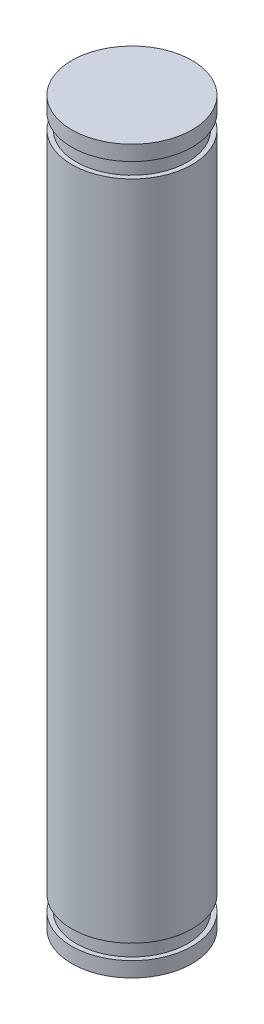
ISO-10303-21;
HEADER;
FILE_DESCRIPTION(('STEP AP214'),'2;1');
FILE_NAME('part.step','',(''),(''),'','','');
FILE_SCHEMA(('AUTOMOTIVE_DESIGN { 1 0 10303 214 1 1 1 1 }'));
ENDSEC;
DATA;
#1=APPLICATION_CONTEXT('core data for automotive mechanical design processes');
#2=APPLICATION_PROTOCOL_DEFINITION('international standard','automotive_design',2000,#1);
#3=PRODUCT_CONTEXT('',#1,'mechanical');
#4=PRODUCT('Part','Part','',(#3));
#5=PRODUCT_RELATED_PRODUCT_CATEGORY('part','',(#4));
#6=PRODUCT_DEFINITION_FORMATION('','',#4);
#7=PRODUCT_DEFINITION_CONTEXT('part definition',#1,'design');
#8=PRODUCT_DEFINITION('design','',#6,#7);
#9=PRODUCT_DEFINITION_SHAPE('','',#8);
#10=(LENGTH_UNIT() NAMED_UNIT(*) SI_UNIT(.MILLI.,.METRE.));
#11=(NAMED_UNIT(*) PLANE_ANGLE_UNIT() SI_UNIT($,.RADIAN.));
#12=(NAMED_UNIT(*) SI_UNIT($,.STERADIAN.) SOLID_ANGLE_UNIT());
#13=UNCERTAINTY_MEASURE_WITH_UNIT(LENGTH_MEASURE(1.E-05),#10,'distance_accuracy_value','');
#14=(GEOMETRIC_REPRESENTATION_CONTEXT(3) GLOBAL_UNCERTAINTY_ASSIGNED_CONTEXT((#13)) GLOBAL_UNIT_ASSIGNED_CONTEXT((#10,
#11,#12)) REPRESENTATION_CONTEXT('',''));
#15=CARTESIAN_POINT('',(0.,0.,0.));
#16=DIRECTION('',(0.,0.,1.));
#17=DIRECTION('',(1.,0.,0.));
#18=AXIS2_PLACEMENT_3D('',#15,#16,#17);
#19=CARTESIAN_POINT('',(0.,1.,0.));
#20=DIRECTION('',(0.,-1.,0.));
#21=DIRECTION('',(0.,0.,-1.));
#22=AXIS2_PLACEMENT_3D('',#19,#20,#21);
#23=CYLINDRICAL_SURFACE('',#22,4.);
#24=CARTESIAN_POINT('',(0.,1.,0.));
#25=DIRECTION('',(0.,1.,0.));
#26=DIRECTION('',(0.,0.,1.));
#27=AXIS2_PLACEMENT_3D('',#24,#25,#26);
#28=CIRCLE('',#27,4.);
#29=CARTESIAN_POINT('',(0.,1.,4.));
#30=VERTEX_POINT('',#29);
#31=EDGE_CURVE('E10',#30,#30,#28,.T.);
#32=ORIENTED_EDGE('',*,*,#31,.F.);
#33=EDGE_LOOP('',(#32));
#34=FACE_BOUND('',#33,.T.);
#35=CARTESIAN_POINT('',(0.,0.,0.));
#36=DIRECTION('',(0.,1.,0.));
#37=DIRECTION('',(0.,0.,1.));
#38=AXIS2_PLACEMENT_3D('',#35,#36,#37);
#39=CIRCLE('',#38,4.);
#40=CARTESIAN_POINT('',(0.,0.,4.));
#41=VERTEX_POINT('',#40);
#42=EDGE_CURVE('E35',#41,#41,#39,.T.);
#43=ORIENTED_EDGE('',*,*,#42,.T.);
#44=EDGE_LOOP('',(#43));
#45=FACE_BOUND('',#44,.T.);
#46=ADVANCED_FACE('F32',(#34,#45),#23,.T.);
#47=CARTESIAN_POINT('',(0.,1.,0.));
#48=DIRECTION('',(0.,1.,0.));
#49=DIRECTION('',(0.,0.,1.));
#50=AXIS2_PLACEMENT_3D('',#47,#48,#49);
#51=PLANE('',#50);
#52=CARTESIAN_POINT('',(0.,1.,0.));
#53=DIRECTION('',(0.,1.,0.));
#54=DIRECTION('',(0.,0.,1.));
#55=AXIS2_PLACEMENT_3D('',#52,#53,#54);
#56=CIRCLE('',#55,3.7);
#57=CARTESIAN_POINT('',(0.,1.,3.7));
#58=VERTEX_POINT('',#57);
#59=EDGE_CURVE('E44',#58,#58,#56,.T.);
#60=ORIENTED_EDGE('',*,*,#59,.F.);
#61=EDGE_LOOP('',(#60));
#62=FACE_BOUND('',#61,.T.);
#63=ORIENTED_EDGE('',*,*,#31,.T.);
#64=EDGE_LOOP('',(#63));
#65=FACE_BOUND('',#64,.T.);
#66=ADVANCED_FACE('F86',(#62,#65),#51,.T.);
#67=CARTESIAN_POINT('',(0.,0.,0.));
#68=DIRECTION('',(0.,1.,0.));
#69=DIRECTION('',(0.,0.,1.));
#70=AXIS2_PLACEMENT_3D('',#67,#68,#69);
#71=PLANE('',#70);
#72=ORIENTED_EDGE('',*,*,#42,.F.);
#73=EDGE_LOOP('',(#72));
#74=FACE_BOUND('',#73,.T.);
#75=ADVANCED_FACE('F91',(#74),#71,.F.);
#76=CARTESIAN_POINT('',(0.,2.,0.));
#77=DIRECTION('',(0.,-1.,0.));
#78=DIRECTION('',(0.,0.,-1.));
#79=AXIS2_PLACEMENT_3D('',#76,#77,#78);
#80=CYLINDRICAL_SURFACE('',#79,3.7);
#81=CARTESIAN_POINT('',(0.,2.,0.));
#82=DIRECTION('',(0.,1.,0.));
#83=DIRECTION('',(0.,0.,1.));
#84=AXIS2_PLACEMENT_3D('',#81,#82,#83);
#85=CIRCLE('',#84,3.7);
#86=CARTESIAN_POINT('',(0.,2.,3.7));
#87=VERTEX_POINT('',#86);
#88=EDGE_CURVE('E42',#87,#87,#85,.T.);
#89=ORIENTED_EDGE('',*,*,#88,.F.);
#90=EDGE_LOOP('',(#89));
#91=FACE_BOUND('',#90,.T.);
#92=ORIENTED_EDGE('',*,*,#59,.T.);
#93=EDGE_LOOP('',(#92));
#94=FACE_BOUND('',#93,.T.);
#95=ADVANCED_FACE('F98',(#91,#94),#80,.T.);
#96=CARTESIAN_POINT('',(0.,46.,0.));
#97=DIRECTION('',(0.,-1.,0.));
#98=DIRECTION('',(0.,0.,-1.));
#99=AXIS2_PLACEMENT_3D('',#96,#97,#98);
#100=CYLINDRICAL_SURFACE('',#99,4.);
#101=CARTESIAN_POINT('',(0.,46.,0.));
#102=DIRECTION('',(0.,1.,0.));
#103=DIRECTION('',(0.,0.,1.));
#104=AXIS2_PLACEMENT_3D('',#101,#102,#103);
#105=CIRCLE('',#104,4.);
#106=CARTESIAN_POINT('',(0.,46.,4.));
#107=VERTEX_POINT('',#106);
#108=EDGE_CURVE('E47',#107,#107,#105,.T.);
#109=ORIENTED_EDGE('',*,*,#108,.F.);
#110=EDGE_LOOP('',(#109));
#111=FACE_BOUND('',#110,.T.);
#112=CARTESIAN_POINT('',(0.,2.,0.));
#113=DIRECTION('',(0.,1.,0.));
#114=DIRECTION('',(0.,0.,1.));
#115=AXIS2_PLACEMENT_3D('',#112,#113,#114);
#116=CIRCLE('',#115,4.);
#117=CARTESIAN_POINT('',(0.,2.,4.));
#118=VERTEX_POINT('',#117);
#119=EDGE_CURVE('E50',#118,#118,#116,.T.);
#120=ORIENTED_EDGE('',*,*,#119,.T.);
#121=EDGE_LOOP('',(#120));
#122=FACE_BOUND('',#121,.T.);
#123=ADVANCED_FACE('F102',(#111,#122),#100,.T.);
#124=CARTESIAN_POINT('',(0.,46.,0.));
#125=DIRECTION('',(0.,1.,0.));
#126=DIRECTION('',(0.,0.,1.));
#127=AXIS2_PLACEMENT_3D('',#124,#125,#126);
#128=PLANE('',#127);
#129=CARTESIAN_POINT('',(0.,46.,0.));
#130=DIRECTION('',(0.,1.,0.));
#131=DIRECTION('',(0.,0.,1.));
#132=AXIS2_PLACEMENT_3D('',#129,#130,#131);
#133=CIRCLE('',#132,3.7);
#134=CARTESIAN_POINT('',(0.,46.,3.7));
#135=VERTEX_POINT('',#134);
#136=EDGE_CURVE('E56',#135,#135,#133,.T.);
#137=ORIENTED_EDGE('',*,*,#136,.F.);
#138=EDGE_LOOP('',(#137));
#139=FACE_BOUND('',#138,.T.);
#140=ORIENTED_EDGE('',*,*,#108,.T.);
#141=EDGE_LOOP('',(#140));
#142=FACE_BOUND('',#141,.T.);
#143=ADVANCED_FACE('F108',(#139,#142),#128,.T.);
#144=CARTESIAN_POINT('',(0.,2.,0.));
#145=DIRECTION('',(0.,1.,0.));
#146=DIRECTION('',(0.,0.,1.));
#147=AXIS2_PLACEMENT_3D('',#144,#145,#146);
#148=PLANE('',#147);
#149=ORIENTED_EDGE('',*,*,#88,.T.);
#150=EDGE_LOOP('',(#149));
#151=FACE_BOUND('',#150,.T.);
#152=ORIENTED_EDGE('',*,*,#119,.F.);
#153=EDGE_LOOP('',(#152));
#154=FACE_BOUND('',#153,.T.);
#155=ADVANCED_FACE('F110',(#151,#154),#148,.F.);
#156=CARTESIAN_POINT('',(0.,47.,0.));
#157=DIRECTION('',(0.,-1.,0.));
#158=DIRECTION('',(0.,0.,-1.));
#159=AXIS2_PLACEMENT_3D('',#156,#157,#158);
#160=CYLINDRICAL_SURFACE('',#159,3.7);
#161=CARTESIAN_POINT('',(0.,47.,0.));
#162=DIRECTION('',(0.,1.,0.));
#163=DIRECTION('',(0.,0.,1.));
#164=AXIS2_PLACEMENT_3D('',#161,#162,#163);
#165=CIRCLE('',#164,3.7);
#166=CARTESIAN_POINT('',(0.,47.,3.7));
#167=VERTEX_POINT('',#166);
#168=EDGE_CURVE('E53',#167,#167,#165,.T.);
#169=ORIENTED_EDGE('',*,*,#168,.F.);
#170=EDGE_LOOP('',(#169));
#171=FACE_BOUND('',#170,.T.);
#172=ORIENTED_EDGE('',*,*,#136,.T.);
#173=EDGE_LOOP('',(#172));
#174=FACE_BOUND('',#173,.T.);
#175=ADVANCED_FACE('F73',(#171,#174),#160,.T.);
#176=CARTESIAN_POINT('',(0.,48.,0.));
#177=DIRECTION('',(0.,-1.,0.));
#178=DIRECTION('',(0.,0.,-1.));
#179=AXIS2_PLACEMENT_3D('',#176,#177,#178);
#180=CYLINDRICAL_SURFACE('',#179,4.);
#181=CARTESIAN_POINT('',(0.,48.,0.));
#182=DIRECTION('',(0.,1.,0.));
#183=DIRECTION('',(0.,0.,1.));
#184=AXIS2_PLACEMENT_3D('',#181,#182,#183);
#185=CIRCLE('',#184,4.);
#186=CARTESIAN_POINT('',(0.,48.,4.));
#187=VERTEX_POINT('',#186);
#188=EDGE_CURVE('E59',#187,#187,#185,.T.);
#189=ORIENTED_EDGE('',*,*,#188,.F.);
#190=EDGE_LOOP('',(#189));
#191=FACE_BOUND('',#190,.T.);
#192=CARTESIAN_POINT('',(0.,47.,0.));
#193=DIRECTION('',(0.,1.,0.));
#194=DIRECTION('',(0.,0.,1.));
#195=AXIS2_PLACEMENT_3D('',#192,#193,#194);
#196=CIRCLE('',#195,4.);
#197=CARTESIAN_POINT('',(0.,47.,4.));
#198=VERTEX_POINT('',#197);
#199=EDGE_CURVE('E62',#198,#198,#196,.T.);
#200=ORIENTED_EDGE('',*,*,#199,.T.);
#201=EDGE_LOOP('',(#200));
#202=FACE_BOUND('',#201,.T.);
#203=ADVANCED_FACE('F70',(#191,#202),#180,.T.);
#204=CARTESIAN_POINT('',(0.,48.,0.));
#205=DIRECTION('',(0.,1.,0.));
#206=DIRECTION('',(0.,0.,1.));
#207=AXIS2_PLACEMENT_3D('',#204,#205,#206);
#208=PLANE('',#207);
#209=ORIENTED_EDGE('',*,*,#188,.T.);
#210=EDGE_LOOP('',(#209));
#211=FACE_BOUND('',#210,.T.);
#212=ADVANCED_FACE('F68',(#211),#208,.T.);
#213=CARTESIAN_POINT('',(0.,47.,0.));
#214=DIRECTION('',(0.,1.,0.));
#215=DIRECTION('',(0.,0.,1.));
#216=AXIS2_PLACEMENT_3D('',#213,#214,#215);
#217=PLANE('',#216);
#218=ORIENTED_EDGE('',*,*,#168,.T.);
#219=EDGE_LOOP('',(#218));
#220=FACE_BOUND('',#219,.T.);
#221=ORIENTED_EDGE('',*,*,#199,.F.);
#222=EDGE_LOOP('',(#221));
#223=FACE_BOUND('',#222,.T.);
#224=ADVANCED_FACE('F77',(#220,#223),#217,.F.);
#225=CLOSED_SHELL('',(#46,#66,#75,#95,#123,#143,#155,#175,#203,#212,#224));
#226=MANIFOLD_SOLID_BREP('B2',#225);
#227=ADVANCED_BREP_SHAPE_REPRESENTATION('',(#18,#226),#14);
#228=SHAPE_DEFINITION_REPRESENTATION(#9,#227);
ENDSEC;
END-ISO-10303-21;
